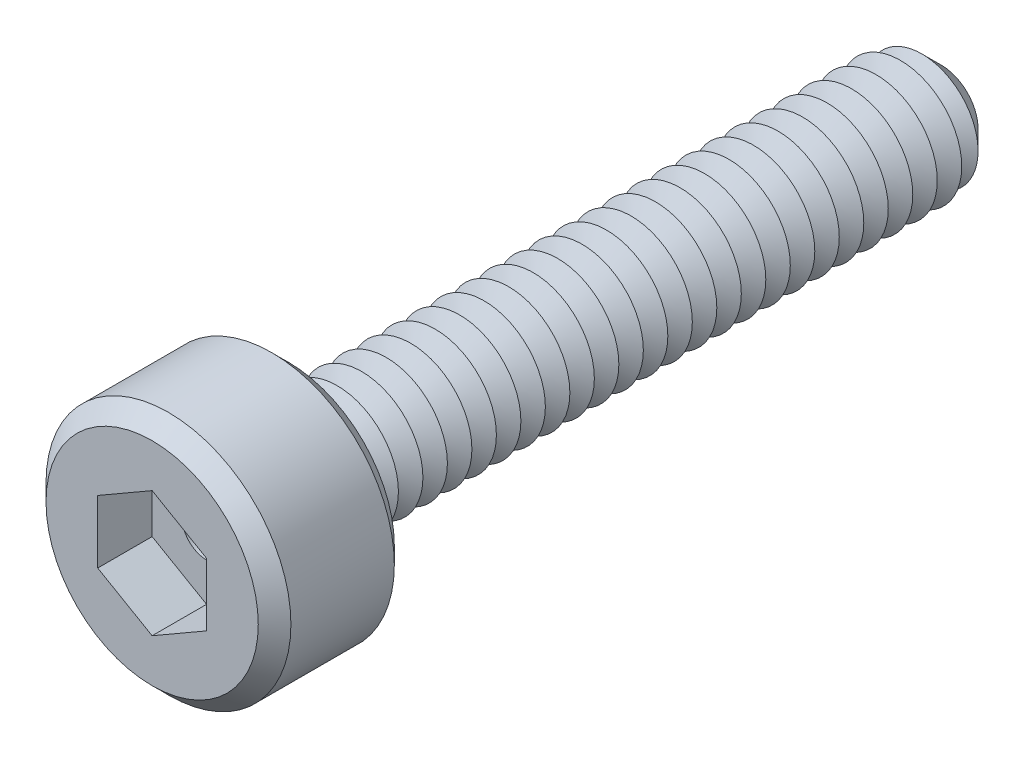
ISO-10303-21;
HEADER;
FILE_DESCRIPTION(('STEP AP214'),'2;1');
FILE_NAME('part.step','',(''),(''),'','','');
FILE_SCHEMA(('AUTOMOTIVE_DESIGN { 1 0 10303 214 1 1 1 1 }'));
ENDSEC;
DATA;
#1=APPLICATION_CONTEXT('core data for automotive mechanical design processes');
#2=APPLICATION_PROTOCOL_DEFINITION('international standard','automotive_design',2000,#1);
#3=PRODUCT_CONTEXT('',#1,'mechanical');
#4=PRODUCT('Part','Part','',(#3));
#5=PRODUCT_RELATED_PRODUCT_CATEGORY('part','',(#4));
#6=PRODUCT_DEFINITION_FORMATION('','',#4);
#7=PRODUCT_DEFINITION_CONTEXT('part definition',#1,'design');
#8=PRODUCT_DEFINITION('design','',#6,#7);
#9=PRODUCT_DEFINITION_SHAPE('','',#8);
#10=(LENGTH_UNIT() NAMED_UNIT(*) SI_UNIT(.MILLI.,.METRE.));
#11=(NAMED_UNIT(*) PLANE_ANGLE_UNIT() SI_UNIT($,.RADIAN.));
#12=(NAMED_UNIT(*) SI_UNIT($,.STERADIAN.) SOLID_ANGLE_UNIT());
#13=UNCERTAINTY_MEASURE_WITH_UNIT(LENGTH_MEASURE(1.E-05),#10,'distance_accuracy_value','');
#14=(GEOMETRIC_REPRESENTATION_CONTEXT(3) GLOBAL_UNCERTAINTY_ASSIGNED_CONTEXT((#13)) GLOBAL_UNIT_ASSIGNED_CONTEXT((#10,
#11,#12)) REPRESENTATION_CONTEXT('',''));
#15=CARTESIAN_POINT('',(0.,0.,0.));
#16=DIRECTION('',(0.,0.,1.));
#17=DIRECTION('',(1.,0.,0.));
#18=AXIS2_PLACEMENT_3D('',#15,#16,#17);
#19=CARTESIAN_POINT('',(0.,0.,2.5));
#20=DIRECTION('',(0.,0.,-1.));
#21=DIRECTION('',(-1.,0.,0.));
#22=AXIS2_PLACEMENT_3D('',#19,#20,#21);
#23=CYLINDRICAL_SURFACE('',#22,2.25);
#24=CARTESIAN_POINT('',(0.,0.,0.299999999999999));
#25=DIRECTION('',(0.,0.,1.));
#26=DIRECTION('',(1.,0.,0.));
#27=AXIS2_PLACEMENT_3D('',#24,#25,#26);
#28=CIRCLE('',#27,2.25);
#29=CARTESIAN_POINT('',(2.25,0.,0.299999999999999));
#30=VERTEX_POINT('',#29);
#31=EDGE_CURVE('E384',#30,#30,#28,.T.);
#32=ORIENTED_EDGE('',*,*,#31,.T.);
#33=EDGE_LOOP('',(#32));
#34=FACE_BOUND('',#33,.T.);
#35=CARTESIAN_POINT('',(0.,0.,2.2));
#36=DIRECTION('',(0.,0.,1.));
#37=DIRECTION('',(1.,0.,0.));
#38=AXIS2_PLACEMENT_3D('',#35,#36,#37);
#39=CIRCLE('',#38,2.25);
#40=CARTESIAN_POINT('',(2.25,0.,2.2));
#41=VERTEX_POINT('',#40);
#42=EDGE_CURVE('E377',#41,#41,#39,.F.);
#43=ORIENTED_EDGE('',*,*,#42,.T.);
#44=EDGE_LOOP('',(#43));
#45=FACE_BOUND('',#44,.T.);
#46=ADVANCED_FACE('F39',(#34,#45),#23,.T.);
#47=CARTESIAN_POINT('',(0.,0.,2.5));
#48=DIRECTION('',(0.,0.,1.));
#49=DIRECTION('',(1.,0.,0.));
#50=AXIS2_PLACEMENT_3D('',#47,#48,#49);
#51=PLANE('',#50);
#52=CARTESIAN_POINT('',(0.,0.,2.5));
#53=DIRECTION('',(0.,0.,1.));
#54=DIRECTION('',(1.,0.,0.));
#55=AXIS2_PLACEMENT_3D('',#52,#53,#54);
#56=CIRCLE('',#55,1.95);
#57=CARTESIAN_POINT('',(1.95,0.,2.5));
#58=VERTEX_POINT('',#57);
#59=EDGE_CURVE('E11',#58,#58,#56,.T.);
#60=ORIENTED_EDGE('',*,*,#59,.T.);
#61=EDGE_LOOP('',(#60));
#62=FACE_BOUND('',#61,.T.);
#63=DIRECTION('',(-0.866025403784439,0.5,0.));
#64=VECTOR('',#63,1.);
#65=CARTESIAN_POINT('',(0.999999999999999,0.577350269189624,2.5));
#66=LINE('',#65,#64);
#67=CARTESIAN_POINT('',(0.999999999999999,0.577350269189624,2.5));
#68=VERTEX_POINT('',#67);
#69=CARTESIAN_POINT('',(0.,1.15470053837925,2.5));
#70=VERTEX_POINT('',#69);
#71=EDGE_CURVE('E55',#68,#70,#66,.T.);
#72=ORIENTED_EDGE('',*,*,#71,.F.);
#73=DIRECTION('',(0.,1.,0.));
#74=VECTOR('',#73,1.);
#75=CARTESIAN_POINT('',(1.,-0.577350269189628,2.5));
#76=LINE('',#75,#74);
#77=CARTESIAN_POINT('',(1.,-0.577350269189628,2.5));
#78=VERTEX_POINT('',#77);
#79=EDGE_CURVE('E150',#78,#68,#76,.T.);
#80=ORIENTED_EDGE('',*,*,#79,.F.);
#81=DIRECTION('',(0.866025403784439,0.5,0.));
#82=VECTOR('',#81,1.);
#83=CARTESIAN_POINT('',(0.,-1.15470053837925,2.5));
#84=LINE('',#83,#82);
#85=CARTESIAN_POINT('',(0.,-1.15470053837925,2.5));
#86=VERTEX_POINT('',#85);
#87=EDGE_CURVE('E147',#86,#78,#84,.T.);
#88=ORIENTED_EDGE('',*,*,#87,.F.);
#89=DIRECTION('',(0.866025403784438,-0.5,0.));
#90=VECTOR('',#89,1.);
#91=CARTESIAN_POINT('',(-1.,-0.577350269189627,2.5));
#92=LINE('',#91,#90);
#93=CARTESIAN_POINT('',(-1.,-0.577350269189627,2.5));
#94=VERTEX_POINT('',#93);
#95=EDGE_CURVE('E103',#94,#86,#92,.T.);
#96=ORIENTED_EDGE('',*,*,#95,.F.);
#97=DIRECTION('',(0.,-1.,0.));
#98=VECTOR('',#97,1.);
#99=CARTESIAN_POINT('',(-1.,0.577350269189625,2.5));
#100=LINE('',#99,#98);
#101=CARTESIAN_POINT('',(-1.,0.577350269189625,2.5));
#102=VERTEX_POINT('',#101);
#103=EDGE_CURVE('E141',#102,#94,#100,.T.);
#104=ORIENTED_EDGE('',*,*,#103,.F.);
#105=DIRECTION('',(-0.866025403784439,-0.5,0.));
#106=VECTOR('',#105,1.);
#107=CARTESIAN_POINT('',(0.,1.15470053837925,2.5));
#108=LINE('',#107,#106);
#109=EDGE_CURVE('E136',#70,#102,#108,.T.);
#110=ORIENTED_EDGE('',*,*,#109,.F.);
#111=EDGE_LOOP('',(#72,#80,#88,#96,#104,#110));
#112=FACE_BOUND('',#111,.T.);
#113=ADVANCED_FACE('F402',(#62,#112),#51,.T.);
#114=CARTESIAN_POINT('',(0.,0.,0.));
#115=DIRECTION('',(0.,0.,1.));
#116=DIRECTION('',(1.,0.,0.));
#117=AXIS2_PLACEMENT_3D('',#114,#115,#116);
#118=PLANE('',#117);
#119=CARTESIAN_POINT('',(0.,0.,0.));
#120=DIRECTION('',(0.,0.,1.));
#121=DIRECTION('',(1.,0.,0.));
#122=AXIS2_PLACEMENT_3D('',#119,#120,#121);
#123=CIRCLE('',#122,1.95);
#124=CARTESIAN_POINT('',(1.95,0.,0.));
#125=VERTEX_POINT('',#124);
#126=EDGE_CURVE('E48',#125,#125,#123,.F.);
#127=ORIENTED_EDGE('',*,*,#126,.T.);
#128=EDGE_LOOP('',(#127));
#129=FACE_BOUND('',#128,.T.);
#130=CARTESIAN_POINT('',(0.,0.,0.));
#131=DIRECTION('',(0.,0.,1.));
#132=DIRECTION('',(1.,0.,0.));
#133=AXIS2_PLACEMENT_3D('',#130,#131,#132);
#134=CIRCLE('',#133,1.125);
#135=CARTESIAN_POINT('',(1.125,0.,0.));
#136=VERTEX_POINT('',#135);
#137=EDGE_CURVE('E369',#136,#136,#134,.T.);
#138=ORIENTED_EDGE('',*,*,#137,.T.);
#139=EDGE_LOOP('',(#138));
#140=FACE_BOUND('',#139,.T.);
#141=ADVANCED_FACE('F391',(#129,#140),#118,.F.);
#142=CARTESIAN_POINT('',(0.,0.,0.));
#143=DIRECTION('',(0.,0.,1.));
#144=DIRECTION('',(1.,0.,0.));
#145=AXIS2_PLACEMENT_3D('',#142,#143,#144);
#146=CONICAL_SURFACE('',#145,1.125,1.0471975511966);
#147=CARTESIAN_POINT('',(0.,0.,-0.225));
#148=DIRECTION('',(0.,0.,1.));
#149=DIRECTION('',(1.,0.,0.));
#150=AXIS2_PLACEMENT_3D('',#147,#148,#149);
#151=CIRCLE('',#150,0.735288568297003);
#152=CARTESIAN_POINT('',(0.735288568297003,0.,-0.225));
#153=VERTEX_POINT('',#152);
#154=EDGE_CURVE('E365',#153,#153,#151,.T.);
#155=ORIENTED_EDGE('',*,*,#154,.T.);
#156=EDGE_LOOP('',(#155));
#157=FACE_BOUND('',#156,.T.);
#158=ORIENTED_EDGE('',*,*,#137,.F.);
#159=EDGE_LOOP('',(#158));
#160=FACE_BOUND('',#159,.T.);
#161=ADVANCED_FACE('F660',(#157,#160),#146,.T.);
#162=CARTESIAN_POINT('',(0.,0.,-0.225));
#163=DIRECTION('',(0.,0.,-1.));
#164=DIRECTION('',(-1.,0.,0.));
#165=AXIS2_PLACEMENT_3D('',#162,#163,#164);
#166=CONICAL_SURFACE('',#165,0.735288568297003,1.0471975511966);
#167=CARTESIAN_POINT('',(0.,0.,-0.45));
#168=DIRECTION('',(0.,0.,1.));
#169=DIRECTION('',(1.,0.,0.));
#170=AXIS2_PLACEMENT_3D('',#167,#168,#169);
#171=CIRCLE('',#170,1.125);
#172=CARTESIAN_POINT('',(1.125,0.,-0.45));
#173=VERTEX_POINT('',#172);
#174=EDGE_CURVE('E361',#173,#173,#171,.T.);
#175=ORIENTED_EDGE('',*,*,#174,.T.);
#176=EDGE_LOOP('',(#175));
#177=FACE_BOUND('',#176,.T.);
#178=ORIENTED_EDGE('',*,*,#154,.F.);
#179=EDGE_LOOP('',(#178));
#180=FACE_BOUND('',#179,.T.);
#181=ADVANCED_FACE('F656',(#177,#180),#166,.T.);
#182=CARTESIAN_POINT('',(0.,0.,-0.45));
#183=DIRECTION('',(0.,0.,1.));
#184=DIRECTION('',(1.,0.,0.));
#185=AXIS2_PLACEMENT_3D('',#182,#183,#184);
#186=CONICAL_SURFACE('',#185,1.125,1.0471975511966);
#187=CARTESIAN_POINT('',(0.,0.,-0.675));
#188=DIRECTION('',(0.,0.,1.));
#189=DIRECTION('',(1.,0.,0.));
#190=AXIS2_PLACEMENT_3D('',#187,#188,#189);
#191=CIRCLE('',#190,0.735288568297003);
#192=CARTESIAN_POINT('',(0.735288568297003,0.,-0.675));
#193=VERTEX_POINT('',#192);
#194=EDGE_CURVE('E357',#193,#193,#191,.T.);
#195=ORIENTED_EDGE('',*,*,#194,.T.);
#196=EDGE_LOOP('',(#195));
#197=FACE_BOUND('',#196,.T.);
#198=ORIENTED_EDGE('',*,*,#174,.F.);
#199=EDGE_LOOP('',(#198));
#200=FACE_BOUND('',#199,.T.);
#201=ADVANCED_FACE('F652',(#197,#200),#186,.T.);
#202=CARTESIAN_POINT('',(0.,0.,-0.675));
#203=DIRECTION('',(0.,0.,-1.));
#204=DIRECTION('',(-1.,0.,0.));
#205=AXIS2_PLACEMENT_3D('',#202,#203,#204);
#206=CONICAL_SURFACE('',#205,0.735288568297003,1.0471975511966);
#207=CARTESIAN_POINT('',(0.,0.,-0.9));
#208=DIRECTION('',(0.,0.,1.));
#209=DIRECTION('',(1.,0.,0.));
#210=AXIS2_PLACEMENT_3D('',#207,#208,#209);
#211=CIRCLE('',#210,1.125);
#212=CARTESIAN_POINT('',(1.125,0.,-0.9));
#213=VERTEX_POINT('',#212);
#214=EDGE_CURVE('E353',#213,#213,#211,.T.);
#215=ORIENTED_EDGE('',*,*,#214,.T.);
#216=EDGE_LOOP('',(#215));
#217=FACE_BOUND('',#216,.T.);
#218=ORIENTED_EDGE('',*,*,#194,.F.);
#219=EDGE_LOOP('',(#218));
#220=FACE_BOUND('',#219,.T.);
#221=ADVANCED_FACE('F648',(#217,#220),#206,.T.);
#222=CARTESIAN_POINT('',(0.,0.,-0.9));
#223=DIRECTION('',(0.,0.,1.));
#224=DIRECTION('',(1.,0.,0.));
#225=AXIS2_PLACEMENT_3D('',#222,#223,#224);
#226=CONICAL_SURFACE('',#225,1.125,1.0471975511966);
#227=CARTESIAN_POINT('',(0.,0.,-1.125));
#228=DIRECTION('',(0.,0.,1.));
#229=DIRECTION('',(1.,0.,0.));
#230=AXIS2_PLACEMENT_3D('',#227,#228,#229);
#231=CIRCLE('',#230,0.735288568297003);
#232=CARTESIAN_POINT('',(0.735288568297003,0.,-1.125));
#233=VERTEX_POINT('',#232);
#234=EDGE_CURVE('E349',#233,#233,#231,.T.);
#235=ORIENTED_EDGE('',*,*,#234,.T.);
#236=EDGE_LOOP('',(#235));
#237=FACE_BOUND('',#236,.T.);
#238=ORIENTED_EDGE('',*,*,#214,.F.);
#239=EDGE_LOOP('',(#238));
#240=FACE_BOUND('',#239,.T.);
#241=ADVANCED_FACE('F644',(#237,#240),#226,.T.);
#242=CARTESIAN_POINT('',(0.,0.,-1.125));
#243=DIRECTION('',(0.,0.,-1.));
#244=DIRECTION('',(-1.,0.,0.));
#245=AXIS2_PLACEMENT_3D('',#242,#243,#244);
#246=CONICAL_SURFACE('',#245,0.735288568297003,1.0471975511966);
#247=CARTESIAN_POINT('',(0.,0.,-1.35));
#248=DIRECTION('',(0.,0.,1.));
#249=DIRECTION('',(1.,0.,0.));
#250=AXIS2_PLACEMENT_3D('',#247,#248,#249);
#251=CIRCLE('',#250,1.125);
#252=CARTESIAN_POINT('',(1.125,0.,-1.35));
#253=VERTEX_POINT('',#252);
#254=EDGE_CURVE('E345',#253,#253,#251,.T.);
#255=ORIENTED_EDGE('',*,*,#254,.T.);
#256=EDGE_LOOP('',(#255));
#257=FACE_BOUND('',#256,.T.);
#258=ORIENTED_EDGE('',*,*,#234,.F.);
#259=EDGE_LOOP('',(#258));
#260=FACE_BOUND('',#259,.T.);
#261=ADVANCED_FACE('F640',(#257,#260),#246,.T.);
#262=CARTESIAN_POINT('',(0.,0.,-1.35));
#263=DIRECTION('',(0.,0.,1.));
#264=DIRECTION('',(1.,0.,0.));
#265=AXIS2_PLACEMENT_3D('',#262,#263,#264);
#266=CONICAL_SURFACE('',#265,1.125,1.0471975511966);
#267=CARTESIAN_POINT('',(0.,0.,-1.575));
#268=DIRECTION('',(0.,0.,1.));
#269=DIRECTION('',(1.,0.,0.));
#270=AXIS2_PLACEMENT_3D('',#267,#268,#269);
#271=CIRCLE('',#270,0.735288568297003);
#272=CARTESIAN_POINT('',(0.735288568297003,0.,-1.575));
#273=VERTEX_POINT('',#272);
#274=EDGE_CURVE('E341',#273,#273,#271,.T.);
#275=ORIENTED_EDGE('',*,*,#274,.T.);
#276=EDGE_LOOP('',(#275));
#277=FACE_BOUND('',#276,.T.);
#278=ORIENTED_EDGE('',*,*,#254,.F.);
#279=EDGE_LOOP('',(#278));
#280=FACE_BOUND('',#279,.T.);
#281=ADVANCED_FACE('F636',(#277,#280),#266,.T.);
#282=CARTESIAN_POINT('',(0.,0.,-1.575));
#283=DIRECTION('',(0.,0.,-1.));
#284=DIRECTION('',(-1.,0.,0.));
#285=AXIS2_PLACEMENT_3D('',#282,#283,#284);
#286=CONICAL_SURFACE('',#285,0.735288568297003,1.0471975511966);
#287=CARTESIAN_POINT('',(0.,0.,-1.8));
#288=DIRECTION('',(0.,0.,1.));
#289=DIRECTION('',(1.,0.,0.));
#290=AXIS2_PLACEMENT_3D('',#287,#288,#289);
#291=CIRCLE('',#290,1.125);
#292=CARTESIAN_POINT('',(1.125,0.,-1.8));
#293=VERTEX_POINT('',#292);
#294=EDGE_CURVE('E337',#293,#293,#291,.T.);
#295=ORIENTED_EDGE('',*,*,#294,.T.);
#296=EDGE_LOOP('',(#295));
#297=FACE_BOUND('',#296,.T.);
#298=ORIENTED_EDGE('',*,*,#274,.F.);
#299=EDGE_LOOP('',(#298));
#300=FACE_BOUND('',#299,.T.);
#301=ADVANCED_FACE('F632',(#297,#300),#286,.T.);
#302=CARTESIAN_POINT('',(0.,0.,-1.8));
#303=DIRECTION('',(0.,0.,1.));
#304=DIRECTION('',(1.,0.,0.));
#305=AXIS2_PLACEMENT_3D('',#302,#303,#304);
#306=CONICAL_SURFACE('',#305,1.125,1.0471975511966);
#307=CARTESIAN_POINT('',(0.,0.,-2.025));
#308=DIRECTION('',(0.,0.,1.));
#309=DIRECTION('',(1.,0.,0.));
#310=AXIS2_PLACEMENT_3D('',#307,#308,#309);
#311=CIRCLE('',#310,0.735288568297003);
#312=CARTESIAN_POINT('',(0.735288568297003,0.,-2.025));
#313=VERTEX_POINT('',#312);
#314=EDGE_CURVE('E333',#313,#313,#311,.T.);
#315=ORIENTED_EDGE('',*,*,#314,.T.);
#316=EDGE_LOOP('',(#315));
#317=FACE_BOUND('',#316,.T.);
#318=ORIENTED_EDGE('',*,*,#294,.F.);
#319=EDGE_LOOP('',(#318));
#320=FACE_BOUND('',#319,.T.);
#321=ADVANCED_FACE('F628',(#317,#320),#306,.T.);
#322=CARTESIAN_POINT('',(0.,0.,-2.025));
#323=DIRECTION('',(0.,0.,-1.));
#324=DIRECTION('',(-1.,0.,0.));
#325=AXIS2_PLACEMENT_3D('',#322,#323,#324);
#326=CONICAL_SURFACE('',#325,0.735288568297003,1.0471975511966);
#327=CARTESIAN_POINT('',(0.,0.,-2.25));
#328=DIRECTION('',(0.,0.,1.));
#329=DIRECTION('',(1.,0.,0.));
#330=AXIS2_PLACEMENT_3D('',#327,#328,#329);
#331=CIRCLE('',#330,1.125);
#332=CARTESIAN_POINT('',(1.125,0.,-2.25));
#333=VERTEX_POINT('',#332);
#334=EDGE_CURVE('E329',#333,#333,#331,.T.);
#335=ORIENTED_EDGE('',*,*,#334,.T.);
#336=EDGE_LOOP('',(#335));
#337=FACE_BOUND('',#336,.T.);
#338=ORIENTED_EDGE('',*,*,#314,.F.);
#339=EDGE_LOOP('',(#338));
#340=FACE_BOUND('',#339,.T.);
#341=ADVANCED_FACE('F624',(#337,#340),#326,.T.);
#342=CARTESIAN_POINT('',(0.,0.,-2.25));
#343=DIRECTION('',(0.,0.,1.));
#344=DIRECTION('',(1.,0.,0.));
#345=AXIS2_PLACEMENT_3D('',#342,#343,#344);
#346=CONICAL_SURFACE('',#345,1.125,1.0471975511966);
#347=CARTESIAN_POINT('',(0.,0.,-2.475));
#348=DIRECTION('',(0.,0.,1.));
#349=DIRECTION('',(1.,0.,0.));
#350=AXIS2_PLACEMENT_3D('',#347,#348,#349);
#351=CIRCLE('',#350,0.735288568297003);
#352=CARTESIAN_POINT('',(0.735288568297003,0.,-2.475));
#353=VERTEX_POINT('',#352);
#354=EDGE_CURVE('E325',#353,#353,#351,.T.);
#355=ORIENTED_EDGE('',*,*,#354,.T.);
#356=EDGE_LOOP('',(#355));
#357=FACE_BOUND('',#356,.T.);
#358=ORIENTED_EDGE('',*,*,#334,.F.);
#359=EDGE_LOOP('',(#358));
#360=FACE_BOUND('',#359,.T.);
#361=ADVANCED_FACE('F620',(#357,#360),#346,.T.);
#362=CARTESIAN_POINT('',(0.,0.,-2.475));
#363=DIRECTION('',(0.,0.,-1.));
#364=DIRECTION('',(-1.,0.,0.));
#365=AXIS2_PLACEMENT_3D('',#362,#363,#364);
#366=CONICAL_SURFACE('',#365,0.735288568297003,1.0471975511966);
#367=CARTESIAN_POINT('',(0.,0.,-2.7));
#368=DIRECTION('',(0.,0.,1.));
#369=DIRECTION('',(1.,0.,0.));
#370=AXIS2_PLACEMENT_3D('',#367,#368,#369);
#371=CIRCLE('',#370,1.125);
#372=CARTESIAN_POINT('',(1.125,0.,-2.7));
#373=VERTEX_POINT('',#372);
#374=EDGE_CURVE('E321',#373,#373,#371,.T.);
#375=ORIENTED_EDGE('',*,*,#374,.T.);
#376=EDGE_LOOP('',(#375));
#377=FACE_BOUND('',#376,.T.);
#378=ORIENTED_EDGE('',*,*,#354,.F.);
#379=EDGE_LOOP('',(#378));
#380=FACE_BOUND('',#379,.T.);
#381=ADVANCED_FACE('F616',(#377,#380),#366,.T.);
#382=CARTESIAN_POINT('',(0.,0.,-2.7));
#383=DIRECTION('',(0.,0.,1.));
#384=DIRECTION('',(1.,0.,0.));
#385=AXIS2_PLACEMENT_3D('',#382,#383,#384);
#386=CONICAL_SURFACE('',#385,1.125,1.0471975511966);
#387=CARTESIAN_POINT('',(0.,0.,-2.925));
#388=DIRECTION('',(0.,0.,1.));
#389=DIRECTION('',(1.,0.,0.));
#390=AXIS2_PLACEMENT_3D('',#387,#388,#389);
#391=CIRCLE('',#390,0.735288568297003);
#392=CARTESIAN_POINT('',(0.735288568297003,0.,-2.925));
#393=VERTEX_POINT('',#392);
#394=EDGE_CURVE('E317',#393,#393,#391,.T.);
#395=ORIENTED_EDGE('',*,*,#394,.T.);
#396=EDGE_LOOP('',(#395));
#397=FACE_BOUND('',#396,.T.);
#398=ORIENTED_EDGE('',*,*,#374,.F.);
#399=EDGE_LOOP('',(#398));
#400=FACE_BOUND('',#399,.T.);
#401=ADVANCED_FACE('F612',(#397,#400),#386,.T.);
#402=CARTESIAN_POINT('',(0.,0.,-2.925));
#403=DIRECTION('',(0.,0.,-1.));
#404=DIRECTION('',(-1.,0.,0.));
#405=AXIS2_PLACEMENT_3D('',#402,#403,#404);
#406=CONICAL_SURFACE('',#405,0.735288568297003,1.0471975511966);
#407=CARTESIAN_POINT('',(0.,0.,-3.15));
#408=DIRECTION('',(0.,0.,1.));
#409=DIRECTION('',(1.,0.,0.));
#410=AXIS2_PLACEMENT_3D('',#407,#408,#409);
#411=CIRCLE('',#410,1.125);
#412=CARTESIAN_POINT('',(1.125,0.,-3.15));
#413=VERTEX_POINT('',#412);
#414=EDGE_CURVE('E313',#413,#413,#411,.T.);
#415=ORIENTED_EDGE('',*,*,#414,.T.);
#416=EDGE_LOOP('',(#415));
#417=FACE_BOUND('',#416,.T.);
#418=ORIENTED_EDGE('',*,*,#394,.F.);
#419=EDGE_LOOP('',(#418));
#420=FACE_BOUND('',#419,.T.);
#421=ADVANCED_FACE('F608',(#417,#420),#406,.T.);
#422=CARTESIAN_POINT('',(0.,0.,-3.15));
#423=DIRECTION('',(0.,0.,1.));
#424=DIRECTION('',(1.,0.,0.));
#425=AXIS2_PLACEMENT_3D('',#422,#423,#424);
#426=CONICAL_SURFACE('',#425,1.125,1.0471975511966);
#427=CARTESIAN_POINT('',(0.,0.,-3.375));
#428=DIRECTION('',(0.,0.,1.));
#429=DIRECTION('',(1.,0.,0.));
#430=AXIS2_PLACEMENT_3D('',#427,#428,#429);
#431=CIRCLE('',#430,0.735288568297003);
#432=CARTESIAN_POINT('',(0.735288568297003,0.,-3.375));
#433=VERTEX_POINT('',#432);
#434=EDGE_CURVE('E309',#433,#433,#431,.T.);
#435=ORIENTED_EDGE('',*,*,#434,.T.);
#436=EDGE_LOOP('',(#435));
#437=FACE_BOUND('',#436,.T.);
#438=ORIENTED_EDGE('',*,*,#414,.F.);
#439=EDGE_LOOP('',(#438));
#440=FACE_BOUND('',#439,.T.);
#441=ADVANCED_FACE('F604',(#437,#440),#426,.T.);
#442=CARTESIAN_POINT('',(0.,0.,-3.375));
#443=DIRECTION('',(0.,0.,-1.));
#444=DIRECTION('',(-1.,0.,0.));
#445=AXIS2_PLACEMENT_3D('',#442,#443,#444);
#446=CONICAL_SURFACE('',#445,0.735288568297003,1.0471975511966);
#447=CARTESIAN_POINT('',(0.,0.,-3.6));
#448=DIRECTION('',(0.,0.,1.));
#449=DIRECTION('',(1.,0.,0.));
#450=AXIS2_PLACEMENT_3D('',#447,#448,#449);
#451=CIRCLE('',#450,1.125);
#452=CARTESIAN_POINT('',(1.125,0.,-3.6));
#453=VERTEX_POINT('',#452);
#454=EDGE_CURVE('E305',#453,#453,#451,.T.);
#455=ORIENTED_EDGE('',*,*,#454,.T.);
#456=EDGE_LOOP('',(#455));
#457=FACE_BOUND('',#456,.T.);
#458=ORIENTED_EDGE('',*,*,#434,.F.);
#459=EDGE_LOOP('',(#458));
#460=FACE_BOUND('',#459,.T.);
#461=ADVANCED_FACE('F600',(#457,#460),#446,.T.);
#462=CARTESIAN_POINT('',(0.,0.,-3.6));
#463=DIRECTION('',(0.,0.,1.));
#464=DIRECTION('',(1.,0.,0.));
#465=AXIS2_PLACEMENT_3D('',#462,#463,#464);
#466=CONICAL_SURFACE('',#465,1.125,1.0471975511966);
#467=CARTESIAN_POINT('',(0.,0.,-3.825));
#468=DIRECTION('',(0.,0.,1.));
#469=DIRECTION('',(1.,0.,0.));
#470=AXIS2_PLACEMENT_3D('',#467,#468,#469);
#471=CIRCLE('',#470,0.735288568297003);
#472=CARTESIAN_POINT('',(0.735288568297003,0.,-3.825));
#473=VERTEX_POINT('',#472);
#474=EDGE_CURVE('E301',#473,#473,#471,.T.);
#475=ORIENTED_EDGE('',*,*,#474,.T.);
#476=EDGE_LOOP('',(#475));
#477=FACE_BOUND('',#476,.T.);
#478=ORIENTED_EDGE('',*,*,#454,.F.);
#479=EDGE_LOOP('',(#478));
#480=FACE_BOUND('',#479,.T.);
#481=ADVANCED_FACE('F596',(#477,#480),#466,.T.);
#482=CARTESIAN_POINT('',(0.,0.,-3.825));
#483=DIRECTION('',(0.,0.,-1.));
#484=DIRECTION('',(-1.,0.,0.));
#485=AXIS2_PLACEMENT_3D('',#482,#483,#484);
#486=CONICAL_SURFACE('',#485,0.735288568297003,1.0471975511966);
#487=CARTESIAN_POINT('',(0.,0.,-4.05));
#488=DIRECTION('',(0.,0.,1.));
#489=DIRECTION('',(1.,0.,0.));
#490=AXIS2_PLACEMENT_3D('',#487,#488,#489);
#491=CIRCLE('',#490,1.125);
#492=CARTESIAN_POINT('',(1.125,0.,-4.05));
#493=VERTEX_POINT('',#492);
#494=EDGE_CURVE('E297',#493,#493,#491,.T.);
#495=ORIENTED_EDGE('',*,*,#494,.T.);
#496=EDGE_LOOP('',(#495));
#497=FACE_BOUND('',#496,.T.);
#498=ORIENTED_EDGE('',*,*,#474,.F.);
#499=EDGE_LOOP('',(#498));
#500=FACE_BOUND('',#499,.T.);
#501=ADVANCED_FACE('F592',(#497,#500),#486,.T.);
#502=CARTESIAN_POINT('',(0.,0.,-4.05));
#503=DIRECTION('',(0.,0.,1.));
#504=DIRECTION('',(1.,0.,0.));
#505=AXIS2_PLACEMENT_3D('',#502,#503,#504);
#506=CONICAL_SURFACE('',#505,1.125,1.0471975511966);
#507=CARTESIAN_POINT('',(0.,0.,-4.275));
#508=DIRECTION('',(0.,0.,1.));
#509=DIRECTION('',(1.,0.,0.));
#510=AXIS2_PLACEMENT_3D('',#507,#508,#509);
#511=CIRCLE('',#510,0.735288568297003);
#512=CARTESIAN_POINT('',(0.735288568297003,0.,-4.275));
#513=VERTEX_POINT('',#512);
#514=EDGE_CURVE('E293',#513,#513,#511,.T.);
#515=ORIENTED_EDGE('',*,*,#514,.T.);
#516=EDGE_LOOP('',(#515));
#517=FACE_BOUND('',#516,.T.);
#518=ORIENTED_EDGE('',*,*,#494,.F.);
#519=EDGE_LOOP('',(#518));
#520=FACE_BOUND('',#519,.T.);
#521=ADVANCED_FACE('F588',(#517,#520),#506,.T.);
#522=CARTESIAN_POINT('',(0.,0.,-4.275));
#523=DIRECTION('',(0.,0.,-1.));
#524=DIRECTION('',(-1.,0.,0.));
#525=AXIS2_PLACEMENT_3D('',#522,#523,#524);
#526=CONICAL_SURFACE('',#525,0.735288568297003,1.0471975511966);
#527=CARTESIAN_POINT('',(0.,0.,-4.5));
#528=DIRECTION('',(0.,0.,1.));
#529=DIRECTION('',(1.,0.,0.));
#530=AXIS2_PLACEMENT_3D('',#527,#528,#529);
#531=CIRCLE('',#530,1.125);
#532=CARTESIAN_POINT('',(1.125,0.,-4.5));
#533=VERTEX_POINT('',#532);
#534=EDGE_CURVE('E289',#533,#533,#531,.T.);
#535=ORIENTED_EDGE('',*,*,#534,.T.);
#536=EDGE_LOOP('',(#535));
#537=FACE_BOUND('',#536,.T.);
#538=ORIENTED_EDGE('',*,*,#514,.F.);
#539=EDGE_LOOP('',(#538));
#540=FACE_BOUND('',#539,.T.);
#541=ADVANCED_FACE('F584',(#537,#540),#526,.T.);
#542=CARTESIAN_POINT('',(0.,0.,-4.5));
#543=DIRECTION('',(0.,0.,1.));
#544=DIRECTION('',(1.,0.,0.));
#545=AXIS2_PLACEMENT_3D('',#542,#543,#544);
#546=CONICAL_SURFACE('',#545,1.125,1.0471975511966);
#547=CARTESIAN_POINT('',(0.,0.,-4.725));
#548=DIRECTION('',(0.,0.,1.));
#549=DIRECTION('',(1.,0.,0.));
#550=AXIS2_PLACEMENT_3D('',#547,#548,#549);
#551=CIRCLE('',#550,0.735288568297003);
#552=CARTESIAN_POINT('',(0.735288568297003,0.,-4.725));
#553=VERTEX_POINT('',#552);
#554=EDGE_CURVE('E285',#553,#553,#551,.T.);
#555=ORIENTED_EDGE('',*,*,#554,.T.);
#556=EDGE_LOOP('',(#555));
#557=FACE_BOUND('',#556,.T.);
#558=ORIENTED_EDGE('',*,*,#534,.F.);
#559=EDGE_LOOP('',(#558));
#560=FACE_BOUND('',#559,.T.);
#561=ADVANCED_FACE('F580',(#557,#560),#546,.T.);
#562=CARTESIAN_POINT('',(0.,0.,-4.725));
#563=DIRECTION('',(0.,0.,-1.));
#564=DIRECTION('',(-1.,0.,0.));
#565=AXIS2_PLACEMENT_3D('',#562,#563,#564);
#566=CONICAL_SURFACE('',#565,0.735288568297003,1.0471975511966);
#567=CARTESIAN_POINT('',(0.,0.,-4.95));
#568=DIRECTION('',(0.,0.,1.));
#569=DIRECTION('',(1.,0.,0.));
#570=AXIS2_PLACEMENT_3D('',#567,#568,#569);
#571=CIRCLE('',#570,1.125);
#572=CARTESIAN_POINT('',(1.125,0.,-4.95));
#573=VERTEX_POINT('',#572);
#574=EDGE_CURVE('E281',#573,#573,#571,.T.);
#575=ORIENTED_EDGE('',*,*,#574,.T.);
#576=EDGE_LOOP('',(#575));
#577=FACE_BOUND('',#576,.T.);
#578=ORIENTED_EDGE('',*,*,#554,.F.);
#579=EDGE_LOOP('',(#578));
#580=FACE_BOUND('',#579,.T.);
#581=ADVANCED_FACE('F576',(#577,#580),#566,.T.);
#582=CARTESIAN_POINT('',(0.,0.,-4.95));
#583=DIRECTION('',(0.,0.,1.));
#584=DIRECTION('',(1.,0.,0.));
#585=AXIS2_PLACEMENT_3D('',#582,#583,#584);
#586=CONICAL_SURFACE('',#585,1.125,1.0471975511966);
#587=CARTESIAN_POINT('',(0.,0.,-5.175));
#588=DIRECTION('',(0.,0.,1.));
#589=DIRECTION('',(1.,0.,0.));
#590=AXIS2_PLACEMENT_3D('',#587,#588,#589);
#591=CIRCLE('',#590,0.735288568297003);
#592=CARTESIAN_POINT('',(0.735288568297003,0.,-5.175));
#593=VERTEX_POINT('',#592);
#594=EDGE_CURVE('E277',#593,#593,#591,.T.);
#595=ORIENTED_EDGE('',*,*,#594,.T.);
#596=EDGE_LOOP('',(#595));
#597=FACE_BOUND('',#596,.T.);
#598=ORIENTED_EDGE('',*,*,#574,.F.);
#599=EDGE_LOOP('',(#598));
#600=FACE_BOUND('',#599,.T.);
#601=ADVANCED_FACE('F572',(#597,#600),#586,.T.);
#602=CARTESIAN_POINT('',(0.,0.,-5.175));
#603=DIRECTION('',(0.,0.,-1.));
#604=DIRECTION('',(-1.,0.,0.));
#605=AXIS2_PLACEMENT_3D('',#602,#603,#604);
#606=CONICAL_SURFACE('',#605,0.735288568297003,1.0471975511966);
#607=CARTESIAN_POINT('',(0.,0.,-5.4));
#608=DIRECTION('',(0.,0.,1.));
#609=DIRECTION('',(1.,0.,0.));
#610=AXIS2_PLACEMENT_3D('',#607,#608,#609);
#611=CIRCLE('',#610,1.125);
#612=CARTESIAN_POINT('',(1.125,0.,-5.4));
#613=VERTEX_POINT('',#612);
#614=EDGE_CURVE('E273',#613,#613,#611,.T.);
#615=ORIENTED_EDGE('',*,*,#614,.T.);
#616=EDGE_LOOP('',(#615));
#617=FACE_BOUND('',#616,.T.);
#618=ORIENTED_EDGE('',*,*,#594,.F.);
#619=EDGE_LOOP('',(#618));
#620=FACE_BOUND('',#619,.T.);
#621=ADVANCED_FACE('F568',(#617,#620),#606,.T.);
#622=CARTESIAN_POINT('',(0.,0.,-5.4));
#623=DIRECTION('',(0.,0.,1.));
#624=DIRECTION('',(1.,0.,0.));
#625=AXIS2_PLACEMENT_3D('',#622,#623,#624);
#626=CONICAL_SURFACE('',#625,1.125,1.0471975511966);
#627=CARTESIAN_POINT('',(0.,0.,-5.625));
#628=DIRECTION('',(0.,0.,1.));
#629=DIRECTION('',(1.,0.,0.));
#630=AXIS2_PLACEMENT_3D('',#627,#628,#629);
#631=CIRCLE('',#630,0.735288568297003);
#632=CARTESIAN_POINT('',(0.735288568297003,0.,-5.625));
#633=VERTEX_POINT('',#632);
#634=EDGE_CURVE('E269',#633,#633,#631,.T.);
#635=ORIENTED_EDGE('',*,*,#634,.T.);
#636=EDGE_LOOP('',(#635));
#637=FACE_BOUND('',#636,.T.);
#638=ORIENTED_EDGE('',*,*,#614,.F.);
#639=EDGE_LOOP('',(#638));
#640=FACE_BOUND('',#639,.T.);
#641=ADVANCED_FACE('F564',(#637,#640),#626,.T.);
#642=CARTESIAN_POINT('',(0.,0.,-5.625));
#643=DIRECTION('',(0.,0.,-1.));
#644=DIRECTION('',(-1.,0.,0.));
#645=AXIS2_PLACEMENT_3D('',#642,#643,#644);
#646=CONICAL_SURFACE('',#645,0.735288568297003,1.0471975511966);
#647=CARTESIAN_POINT('',(0.,0.,-5.85));
#648=DIRECTION('',(0.,0.,1.));
#649=DIRECTION('',(1.,0.,0.));
#650=AXIS2_PLACEMENT_3D('',#647,#648,#649);
#651=CIRCLE('',#650,1.125);
#652=CARTESIAN_POINT('',(1.125,0.,-5.85));
#653=VERTEX_POINT('',#652);
#654=EDGE_CURVE('E265',#653,#653,#651,.T.);
#655=ORIENTED_EDGE('',*,*,#654,.T.);
#656=EDGE_LOOP('',(#655));
#657=FACE_BOUND('',#656,.T.);
#658=ORIENTED_EDGE('',*,*,#634,.F.);
#659=EDGE_LOOP('',(#658));
#660=FACE_BOUND('',#659,.T.);
#661=ADVANCED_FACE('F560',(#657,#660),#646,.T.);
#662=CARTESIAN_POINT('',(0.,0.,-5.85));
#663=DIRECTION('',(0.,0.,1.));
#664=DIRECTION('',(1.,0.,0.));
#665=AXIS2_PLACEMENT_3D('',#662,#663,#664);
#666=CONICAL_SURFACE('',#665,1.125,1.0471975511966);
#667=CARTESIAN_POINT('',(0.,0.,-6.075));
#668=DIRECTION('',(0.,0.,1.));
#669=DIRECTION('',(1.,0.,0.));
#670=AXIS2_PLACEMENT_3D('',#667,#668,#669);
#671=CIRCLE('',#670,0.735288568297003);
#672=CARTESIAN_POINT('',(0.735288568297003,0.,-6.075));
#673=VERTEX_POINT('',#672);
#674=EDGE_CURVE('E261',#673,#673,#671,.T.);
#675=ORIENTED_EDGE('',*,*,#674,.T.);
#676=EDGE_LOOP('',(#675));
#677=FACE_BOUND('',#676,.T.);
#678=ORIENTED_EDGE('',*,*,#654,.F.);
#679=EDGE_LOOP('',(#678));
#680=FACE_BOUND('',#679,.T.);
#681=ADVANCED_FACE('F556',(#677,#680),#666,.T.);
#682=CARTESIAN_POINT('',(0.,0.,-6.075));
#683=DIRECTION('',(0.,0.,-1.));
#684=DIRECTION('',(-1.,0.,0.));
#685=AXIS2_PLACEMENT_3D('',#682,#683,#684);
#686=CONICAL_SURFACE('',#685,0.735288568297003,1.0471975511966);
#687=CARTESIAN_POINT('',(0.,0.,-6.3));
#688=DIRECTION('',(0.,0.,1.));
#689=DIRECTION('',(1.,0.,0.));
#690=AXIS2_PLACEMENT_3D('',#687,#688,#689);
#691=CIRCLE('',#690,1.125);
#692=CARTESIAN_POINT('',(1.125,0.,-6.3));
#693=VERTEX_POINT('',#692);
#694=EDGE_CURVE('E257',#693,#693,#691,.T.);
#695=ORIENTED_EDGE('',*,*,#694,.T.);
#696=EDGE_LOOP('',(#695));
#697=FACE_BOUND('',#696,.T.);
#698=ORIENTED_EDGE('',*,*,#674,.F.);
#699=EDGE_LOOP('',(#698));
#700=FACE_BOUND('',#699,.T.);
#701=ADVANCED_FACE('F552',(#697,#700),#686,.T.);
#702=CARTESIAN_POINT('',(0.,0.,-6.3));
#703=DIRECTION('',(0.,0.,1.));
#704=DIRECTION('',(1.,0.,0.));
#705=AXIS2_PLACEMENT_3D('',#702,#703,#704);
#706=CONICAL_SURFACE('',#705,1.125,1.0471975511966);
#707=CARTESIAN_POINT('',(0.,0.,-6.525));
#708=DIRECTION('',(0.,0.,1.));
#709=DIRECTION('',(1.,0.,0.));
#710=AXIS2_PLACEMENT_3D('',#707,#708,#709);
#711=CIRCLE('',#710,0.735288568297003);
#712=CARTESIAN_POINT('',(0.735288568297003,0.,-6.525));
#713=VERTEX_POINT('',#712);
#714=EDGE_CURVE('E253',#713,#713,#711,.T.);
#715=ORIENTED_EDGE('',*,*,#714,.T.);
#716=EDGE_LOOP('',(#715));
#717=FACE_BOUND('',#716,.T.);
#718=ORIENTED_EDGE('',*,*,#694,.F.);
#719=EDGE_LOOP('',(#718));
#720=FACE_BOUND('',#719,.T.);
#721=ADVANCED_FACE('F548',(#717,#720),#706,.T.);
#722=CARTESIAN_POINT('',(0.,0.,-6.525));
#723=DIRECTION('',(0.,0.,-1.));
#724=DIRECTION('',(-1.,0.,0.));
#725=AXIS2_PLACEMENT_3D('',#722,#723,#724);
#726=CONICAL_SURFACE('',#725,0.735288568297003,1.0471975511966);
#727=CARTESIAN_POINT('',(0.,0.,-6.75));
#728=DIRECTION('',(0.,0.,1.));
#729=DIRECTION('',(1.,0.,0.));
#730=AXIS2_PLACEMENT_3D('',#727,#728,#729);
#731=CIRCLE('',#730,1.125);
#732=CARTESIAN_POINT('',(1.125,0.,-6.75));
#733=VERTEX_POINT('',#732);
#734=EDGE_CURVE('E249',#733,#733,#731,.T.);
#735=ORIENTED_EDGE('',*,*,#734,.T.);
#736=EDGE_LOOP('',(#735));
#737=FACE_BOUND('',#736,.T.);
#738=ORIENTED_EDGE('',*,*,#714,.F.);
#739=EDGE_LOOP('',(#738));
#740=FACE_BOUND('',#739,.T.);
#741=ADVANCED_FACE('F544',(#737,#740),#726,.T.);
#742=CARTESIAN_POINT('',(0.,0.,-6.75));
#743=DIRECTION('',(0.,0.,1.));
#744=DIRECTION('',(1.,0.,0.));
#745=AXIS2_PLACEMENT_3D('',#742,#743,#744);
#746=CONICAL_SURFACE('',#745,1.125,1.0471975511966);
#747=CARTESIAN_POINT('',(0.,0.,-6.975));
#748=DIRECTION('',(0.,0.,1.));
#749=DIRECTION('',(1.,0.,0.));
#750=AXIS2_PLACEMENT_3D('',#747,#748,#749);
#751=CIRCLE('',#750,0.735288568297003);
#752=CARTESIAN_POINT('',(0.735288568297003,0.,-6.975));
#753=VERTEX_POINT('',#752);
#754=EDGE_CURVE('E245',#753,#753,#751,.T.);
#755=ORIENTED_EDGE('',*,*,#754,.T.);
#756=EDGE_LOOP('',(#755));
#757=FACE_BOUND('',#756,.T.);
#758=ORIENTED_EDGE('',*,*,#734,.F.);
#759=EDGE_LOOP('',(#758));
#760=FACE_BOUND('',#759,.T.);
#761=ADVANCED_FACE('F540',(#757,#760),#746,.T.);
#762=CARTESIAN_POINT('',(0.,0.,-6.975));
#763=DIRECTION('',(0.,0.,-1.));
#764=DIRECTION('',(-1.,0.,0.));
#765=AXIS2_PLACEMENT_3D('',#762,#763,#764);
#766=CONICAL_SURFACE('',#765,0.735288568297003,1.0471975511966);
#767=CARTESIAN_POINT('',(0.,0.,-7.2));
#768=DIRECTION('',(0.,0.,1.));
#769=DIRECTION('',(1.,0.,0.));
#770=AXIS2_PLACEMENT_3D('',#767,#768,#769);
#771=CIRCLE('',#770,1.125);
#772=CARTESIAN_POINT('',(1.125,0.,-7.2));
#773=VERTEX_POINT('',#772);
#774=EDGE_CURVE('E241',#773,#773,#771,.T.);
#775=ORIENTED_EDGE('',*,*,#774,.T.);
#776=EDGE_LOOP('',(#775));
#777=FACE_BOUND('',#776,.T.);
#778=ORIENTED_EDGE('',*,*,#754,.F.);
#779=EDGE_LOOP('',(#778));
#780=FACE_BOUND('',#779,.T.);
#781=ADVANCED_FACE('F536',(#777,#780),#766,.T.);
#782=CARTESIAN_POINT('',(0.,0.,-7.2));
#783=DIRECTION('',(0.,0.,1.));
#784=DIRECTION('',(1.,0.,0.));
#785=AXIS2_PLACEMENT_3D('',#782,#783,#784);
#786=CONICAL_SURFACE('',#785,1.125,1.0471975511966);
#787=CARTESIAN_POINT('',(0.,0.,-7.425));
#788=DIRECTION('',(0.,0.,1.));
#789=DIRECTION('',(1.,0.,0.));
#790=AXIS2_PLACEMENT_3D('',#787,#788,#789);
#791=CIRCLE('',#790,0.735288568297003);
#792=CARTESIAN_POINT('',(0.735288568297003,0.,-7.425));
#793=VERTEX_POINT('',#792);
#794=EDGE_CURVE('E237',#793,#793,#791,.T.);
#795=ORIENTED_EDGE('',*,*,#794,.T.);
#796=EDGE_LOOP('',(#795));
#797=FACE_BOUND('',#796,.T.);
#798=ORIENTED_EDGE('',*,*,#774,.F.);
#799=EDGE_LOOP('',(#798));
#800=FACE_BOUND('',#799,.T.);
#801=ADVANCED_FACE('F532',(#797,#800),#786,.T.);
#802=CARTESIAN_POINT('',(0.,0.,-7.425));
#803=DIRECTION('',(0.,0.,-1.));
#804=DIRECTION('',(-1.,0.,0.));
#805=AXIS2_PLACEMENT_3D('',#802,#803,#804);
#806=CONICAL_SURFACE('',#805,0.735288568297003,1.0471975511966);
#807=CARTESIAN_POINT('',(0.,0.,-7.65));
#808=DIRECTION('',(0.,0.,1.));
#809=DIRECTION('',(1.,0.,0.));
#810=AXIS2_PLACEMENT_3D('',#807,#808,#809);
#811=CIRCLE('',#810,1.125);
#812=CARTESIAN_POINT('',(1.125,0.,-7.65));
#813=VERTEX_POINT('',#812);
#814=EDGE_CURVE('E233',#813,#813,#811,.T.);
#815=ORIENTED_EDGE('',*,*,#814,.T.);
#816=EDGE_LOOP('',(#815));
#817=FACE_BOUND('',#816,.T.);
#818=ORIENTED_EDGE('',*,*,#794,.F.);
#819=EDGE_LOOP('',(#818));
#820=FACE_BOUND('',#819,.T.);
#821=ADVANCED_FACE('F528',(#817,#820),#806,.T.);
#822=CARTESIAN_POINT('',(0.,0.,-7.65));
#823=DIRECTION('',(0.,0.,1.));
#824=DIRECTION('',(1.,0.,0.));
#825=AXIS2_PLACEMENT_3D('',#822,#823,#824);
#826=CONICAL_SURFACE('',#825,1.125,1.0471975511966);
#827=CARTESIAN_POINT('',(0.,0.,-7.875));
#828=DIRECTION('',(0.,0.,1.));
#829=DIRECTION('',(1.,0.,0.));
#830=AXIS2_PLACEMENT_3D('',#827,#828,#829);
#831=CIRCLE('',#830,0.735288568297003);
#832=CARTESIAN_POINT('',(0.735288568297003,0.,-7.875));
#833=VERTEX_POINT('',#832);
#834=EDGE_CURVE('E229',#833,#833,#831,.T.);
#835=ORIENTED_EDGE('',*,*,#834,.T.);
#836=EDGE_LOOP('',(#835));
#837=FACE_BOUND('',#836,.T.);
#838=ORIENTED_EDGE('',*,*,#814,.F.);
#839=EDGE_LOOP('',(#838));
#840=FACE_BOUND('',#839,.T.);
#841=ADVANCED_FACE('F524',(#837,#840),#826,.T.);
#842=CARTESIAN_POINT('',(0.,0.,-7.875));
#843=DIRECTION('',(0.,0.,-1.));
#844=DIRECTION('',(-1.,0.,0.));
#845=AXIS2_PLACEMENT_3D('',#842,#843,#844);
#846=CONICAL_SURFACE('',#845,0.735288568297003,1.0471975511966);
#847=CARTESIAN_POINT('',(0.,0.,-8.1));
#848=DIRECTION('',(0.,0.,1.));
#849=DIRECTION('',(1.,0.,0.));
#850=AXIS2_PLACEMENT_3D('',#847,#848,#849);
#851=CIRCLE('',#850,1.125);
#852=CARTESIAN_POINT('',(1.125,0.,-8.1));
#853=VERTEX_POINT('',#852);
#854=EDGE_CURVE('E225',#853,#853,#851,.T.);
#855=ORIENTED_EDGE('',*,*,#854,.T.);
#856=EDGE_LOOP('',(#855));
#857=FACE_BOUND('',#856,.T.);
#858=ORIENTED_EDGE('',*,*,#834,.F.);
#859=EDGE_LOOP('',(#858));
#860=FACE_BOUND('',#859,.T.);
#861=ADVANCED_FACE('F520',(#857,#860),#846,.T.);
#862=CARTESIAN_POINT('',(0.,0.,-8.1));
#863=DIRECTION('',(0.,0.,1.));
#864=DIRECTION('',(1.,0.,0.));
#865=AXIS2_PLACEMENT_3D('',#862,#863,#864);
#866=CONICAL_SURFACE('',#865,1.125,1.0471975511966);
#867=CARTESIAN_POINT('',(0.,0.,-8.325));
#868=DIRECTION('',(0.,0.,1.));
#869=DIRECTION('',(1.,0.,0.));
#870=AXIS2_PLACEMENT_3D('',#867,#868,#869);
#871=CIRCLE('',#870,0.735288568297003);
#872=CARTESIAN_POINT('',(0.735288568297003,0.,-8.325));
#873=VERTEX_POINT('',#872);
#874=EDGE_CURVE('E221',#873,#873,#871,.T.);
#875=ORIENTED_EDGE('',*,*,#874,.T.);
#876=EDGE_LOOP('',(#875));
#877=FACE_BOUND('',#876,.T.);
#878=ORIENTED_EDGE('',*,*,#854,.F.);
#879=EDGE_LOOP('',(#878));
#880=FACE_BOUND('',#879,.T.);
#881=ADVANCED_FACE('F516',(#877,#880),#866,.T.);
#882=CARTESIAN_POINT('',(0.,0.,-8.325));
#883=DIRECTION('',(0.,0.,-1.));
#884=DIRECTION('',(-1.,0.,0.));
#885=AXIS2_PLACEMENT_3D('',#882,#883,#884);
#886=CONICAL_SURFACE('',#885,0.735288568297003,1.0471975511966);
#887=CARTESIAN_POINT('',(0.,0.,-8.55));
#888=DIRECTION('',(0.,0.,1.));
#889=DIRECTION('',(1.,0.,0.));
#890=AXIS2_PLACEMENT_3D('',#887,#888,#889);
#891=CIRCLE('',#890,1.125);
#892=CARTESIAN_POINT('',(1.125,0.,-8.55));
#893=VERTEX_POINT('',#892);
#894=EDGE_CURVE('E217',#893,#893,#891,.T.);
#895=ORIENTED_EDGE('',*,*,#894,.T.);
#896=EDGE_LOOP('',(#895));
#897=FACE_BOUND('',#896,.T.);
#898=ORIENTED_EDGE('',*,*,#874,.F.);
#899=EDGE_LOOP('',(#898));
#900=FACE_BOUND('',#899,.T.);
#901=ADVANCED_FACE('F512',(#897,#900),#886,.T.);
#902=CARTESIAN_POINT('',(0.,0.,-8.55));
#903=DIRECTION('',(0.,0.,1.));
#904=DIRECTION('',(1.,0.,0.));
#905=AXIS2_PLACEMENT_3D('',#902,#903,#904);
#906=CONICAL_SURFACE('',#905,1.125,1.0471975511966);
#907=CARTESIAN_POINT('',(0.,0.,-8.775));
#908=DIRECTION('',(0.,0.,1.));
#909=DIRECTION('',(1.,0.,0.));
#910=AXIS2_PLACEMENT_3D('',#907,#908,#909);
#911=CIRCLE('',#910,0.735288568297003);
#912=CARTESIAN_POINT('',(0.735288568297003,0.,-8.775));
#913=VERTEX_POINT('',#912);
#914=EDGE_CURVE('E213',#913,#913,#911,.T.);
#915=ORIENTED_EDGE('',*,*,#914,.T.);
#916=EDGE_LOOP('',(#915));
#917=FACE_BOUND('',#916,.T.);
#918=ORIENTED_EDGE('',*,*,#894,.F.);
#919=EDGE_LOOP('',(#918));
#920=FACE_BOUND('',#919,.T.);
#921=ADVANCED_FACE('F508',(#917,#920),#906,.T.);
#922=CARTESIAN_POINT('',(0.,0.,-8.775));
#923=DIRECTION('',(0.,0.,-1.));
#924=DIRECTION('',(-1.,0.,0.));
#925=AXIS2_PLACEMENT_3D('',#922,#923,#924);
#926=CONICAL_SURFACE('',#925,0.735288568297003,1.0471975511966);
#927=CARTESIAN_POINT('',(0.,0.,-9.));
#928=DIRECTION('',(0.,0.,1.));
#929=DIRECTION('',(1.,0.,0.));
#930=AXIS2_PLACEMENT_3D('',#927,#928,#929);
#931=CIRCLE('',#930,1.125);
#932=CARTESIAN_POINT('',(1.125,0.,-9.));
#933=VERTEX_POINT('',#932);
#934=EDGE_CURVE('E209',#933,#933,#931,.T.);
#935=ORIENTED_EDGE('',*,*,#934,.T.);
#936=EDGE_LOOP('',(#935));
#937=FACE_BOUND('',#936,.T.);
#938=ORIENTED_EDGE('',*,*,#914,.F.);
#939=EDGE_LOOP('',(#938));
#940=FACE_BOUND('',#939,.T.);
#941=ADVANCED_FACE('F504',(#937,#940),#926,.T.);
#942=CARTESIAN_POINT('',(0.,0.,-9.));
#943=DIRECTION('',(0.,0.,1.));
#944=DIRECTION('',(1.,0.,0.));
#945=AXIS2_PLACEMENT_3D('',#942,#943,#944);
#946=CONICAL_SURFACE('',#945,1.125,1.0471975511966);
#947=CARTESIAN_POINT('',(0.,0.,-9.225));
#948=DIRECTION('',(0.,0.,1.));
#949=DIRECTION('',(1.,0.,0.));
#950=AXIS2_PLACEMENT_3D('',#947,#948,#949);
#951=CIRCLE('',#950,0.735288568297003);
#952=CARTESIAN_POINT('',(0.735288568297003,0.,-9.225));
#953=VERTEX_POINT('',#952);
#954=EDGE_CURVE('E205',#953,#953,#951,.T.);
#955=ORIENTED_EDGE('',*,*,#954,.T.);
#956=EDGE_LOOP('',(#955));
#957=FACE_BOUND('',#956,.T.);
#958=ORIENTED_EDGE('',*,*,#934,.F.);
#959=EDGE_LOOP('',(#958));
#960=FACE_BOUND('',#959,.T.);
#961=ADVANCED_FACE('F500',(#957,#960),#946,.T.);
#962=CARTESIAN_POINT('',(0.,0.,-9.225));
#963=DIRECTION('',(0.,0.,-1.));
#964=DIRECTION('',(-1.,0.,0.));
#965=AXIS2_PLACEMENT_3D('',#962,#963,#964);
#966=CONICAL_SURFACE('',#965,0.735288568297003,1.0471975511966);
#967=CARTESIAN_POINT('',(0.,0.,-9.45));
#968=DIRECTION('',(0.,0.,1.));
#969=DIRECTION('',(1.,0.,0.));
#970=AXIS2_PLACEMENT_3D('',#967,#968,#969);
#971=CIRCLE('',#970,1.125);
#972=CARTESIAN_POINT('',(1.125,0.,-9.45));
#973=VERTEX_POINT('',#972);
#974=EDGE_CURVE('E201',#973,#973,#971,.T.);
#975=ORIENTED_EDGE('',*,*,#974,.T.);
#976=EDGE_LOOP('',(#975));
#977=FACE_BOUND('',#976,.T.);
#978=ORIENTED_EDGE('',*,*,#954,.F.);
#979=EDGE_LOOP('',(#978));
#980=FACE_BOUND('',#979,.T.);
#981=ADVANCED_FACE('F496',(#977,#980),#966,.T.);
#982=CARTESIAN_POINT('',(0.,0.,-9.45));
#983=DIRECTION('',(0.,0.,1.));
#984=DIRECTION('',(1.,0.,0.));
#985=AXIS2_PLACEMENT_3D('',#982,#983,#984);
#986=CONICAL_SURFACE('',#985,1.125,1.0471975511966);
#987=CARTESIAN_POINT('',(0.,0.,-9.675));
#988=DIRECTION('',(0.,0.,1.));
#989=DIRECTION('',(1.,0.,0.));
#990=AXIS2_PLACEMENT_3D('',#987,#988,#989);
#991=CIRCLE('',#990,0.735288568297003);
#992=CARTESIAN_POINT('',(0.735288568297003,0.,-9.675));
#993=VERTEX_POINT('',#992);
#994=EDGE_CURVE('E197',#993,#993,#991,.T.);
#995=ORIENTED_EDGE('',*,*,#994,.T.);
#996=EDGE_LOOP('',(#995));
#997=FACE_BOUND('',#996,.T.);
#998=ORIENTED_EDGE('',*,*,#974,.F.);
#999=EDGE_LOOP('',(#998));
#1000=FACE_BOUND('',#999,.T.);
#1001=ADVANCED_FACE('F492',(#997,#1000),#986,.T.);
#1002=CARTESIAN_POINT('',(0.,0.,-9.675));
#1003=DIRECTION('',(0.,0.,-1.));
#1004=DIRECTION('',(-1.,0.,0.));
#1005=AXIS2_PLACEMENT_3D('',#1002,#1003,#1004);
#1006=CONICAL_SURFACE('',#1005,0.735288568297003,1.0471975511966);
#1007=CARTESIAN_POINT('',(0.,0.,-9.9));
#1008=DIRECTION('',(0.,0.,1.));
#1009=DIRECTION('',(1.,0.,0.));
#1010=AXIS2_PLACEMENT_3D('',#1007,#1008,#1009);
#1011=CIRCLE('',#1010,1.125);
#1012=CARTESIAN_POINT('',(1.125,0.,-9.9));
#1013=VERTEX_POINT('',#1012);
#1014=EDGE_CURVE('E193',#1013,#1013,#1011,.T.);
#1015=ORIENTED_EDGE('',*,*,#1014,.T.);
#1016=EDGE_LOOP('',(#1015));
#1017=FACE_BOUND('',#1016,.T.);
#1018=ORIENTED_EDGE('',*,*,#994,.F.);
#1019=EDGE_LOOP('',(#1018));
#1020=FACE_BOUND('',#1019,.T.);
#1021=ADVANCED_FACE('F488',(#1017,#1020),#1006,.T.);
#1022=CARTESIAN_POINT('',(0.,0.,-9.9));
#1023=DIRECTION('',(0.,0.,1.));
#1024=DIRECTION('',(1.,0.,0.));
#1025=AXIS2_PLACEMENT_3D('',#1022,#1023,#1024);
#1026=CONICAL_SURFACE('',#1025,1.125,1.0471975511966);
#1027=CARTESIAN_POINT('',(0.,0.,-10.125));
#1028=DIRECTION('',(0.,0.,1.));
#1029=DIRECTION('',(1.,0.,0.));
#1030=AXIS2_PLACEMENT_3D('',#1027,#1028,#1029);
#1031=CIRCLE('',#1030,0.735288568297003);
#1032=CARTESIAN_POINT('',(0.735288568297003,0.,-10.125));
#1033=VERTEX_POINT('',#1032);
#1034=EDGE_CURVE('E189',#1033,#1033,#1031,.T.);
#1035=ORIENTED_EDGE('',*,*,#1034,.T.);
#1036=EDGE_LOOP('',(#1035));
#1037=FACE_BOUND('',#1036,.T.);
#1038=ORIENTED_EDGE('',*,*,#1014,.F.);
#1039=EDGE_LOOP('',(#1038));
#1040=FACE_BOUND('',#1039,.T.);
#1041=ADVANCED_FACE('F484',(#1037,#1040),#1026,.T.);
#1042=CARTESIAN_POINT('',(0.,0.,-10.125));
#1043=DIRECTION('',(0.,0.,-1.));
#1044=DIRECTION('',(-1.,0.,0.));
#1045=AXIS2_PLACEMENT_3D('',#1042,#1043,#1044);
#1046=CONICAL_SURFACE('',#1045,0.735288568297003,1.0471975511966);
#1047=CARTESIAN_POINT('',(0.,0.,-10.35));
#1048=DIRECTION('',(0.,0.,1.));
#1049=DIRECTION('',(1.,0.,0.));
#1050=AXIS2_PLACEMENT_3D('',#1047,#1048,#1049);
#1051=CIRCLE('',#1050,1.125);
#1052=CARTESIAN_POINT('',(1.125,0.,-10.35));
#1053=VERTEX_POINT('',#1052);
#1054=EDGE_CURVE('E185',#1053,#1053,#1051,.T.);
#1055=ORIENTED_EDGE('',*,*,#1054,.T.);
#1056=EDGE_LOOP('',(#1055));
#1057=FACE_BOUND('',#1056,.T.);
#1058=ORIENTED_EDGE('',*,*,#1034,.F.);
#1059=EDGE_LOOP('',(#1058));
#1060=FACE_BOUND('',#1059,.T.);
#1061=ADVANCED_FACE('F480',(#1057,#1060),#1046,.T.);
#1062=CARTESIAN_POINT('',(0.,0.,-10.35));
#1063=DIRECTION('',(0.,0.,1.));
#1064=DIRECTION('',(1.,0.,0.));
#1065=AXIS2_PLACEMENT_3D('',#1062,#1063,#1064);
#1066=CONICAL_SURFACE('',#1065,1.125,1.0471975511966);
#1067=CARTESIAN_POINT('',(0.,0.,-10.575));
#1068=DIRECTION('',(0.,0.,1.));
#1069=DIRECTION('',(1.,0.,0.));
#1070=AXIS2_PLACEMENT_3D('',#1067,#1068,#1069);
#1071=CIRCLE('',#1070,0.735288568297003);
#1072=CARTESIAN_POINT('',(0.735288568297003,0.,-10.575));
#1073=VERTEX_POINT('',#1072);
#1074=EDGE_CURVE('E181',#1073,#1073,#1071,.T.);
#1075=ORIENTED_EDGE('',*,*,#1074,.T.);
#1076=EDGE_LOOP('',(#1075));
#1077=FACE_BOUND('',#1076,.T.);
#1078=ORIENTED_EDGE('',*,*,#1054,.F.);
#1079=EDGE_LOOP('',(#1078));
#1080=FACE_BOUND('',#1079,.T.);
#1081=ADVANCED_FACE('F476',(#1077,#1080),#1066,.T.);
#1082=CARTESIAN_POINT('',(0.,0.,-10.575));
#1083=DIRECTION('',(0.,0.,-1.));
#1084=DIRECTION('',(-1.,0.,0.));
#1085=AXIS2_PLACEMENT_3D('',#1082,#1083,#1084);
#1086=CONICAL_SURFACE('',#1085,0.735288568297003,1.0471975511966);
#1087=CARTESIAN_POINT('',(0.,0.,-10.8));
#1088=DIRECTION('',(0.,0.,1.));
#1089=DIRECTION('',(1.,0.,0.));
#1090=AXIS2_PLACEMENT_3D('',#1087,#1088,#1089);
#1091=CIRCLE('',#1090,1.125);
#1092=CARTESIAN_POINT('',(1.125,0.,-10.8));
#1093=VERTEX_POINT('',#1092);
#1094=EDGE_CURVE('E177',#1093,#1093,#1091,.T.);
#1095=ORIENTED_EDGE('',*,*,#1094,.T.);
#1096=EDGE_LOOP('',(#1095));
#1097=FACE_BOUND('',#1096,.T.);
#1098=ORIENTED_EDGE('',*,*,#1074,.F.);
#1099=EDGE_LOOP('',(#1098));
#1100=FACE_BOUND('',#1099,.T.);
#1101=ADVANCED_FACE('F472',(#1097,#1100),#1086,.T.);
#1102=CARTESIAN_POINT('',(0.,0.,-10.8));
#1103=DIRECTION('',(0.,0.,1.));
#1104=DIRECTION('',(1.,0.,0.));
#1105=AXIS2_PLACEMENT_3D('',#1102,#1103,#1104);
#1106=CONICAL_SURFACE('',#1105,1.125,1.0471975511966);
#1107=CARTESIAN_POINT('',(0.,0.,-11.025));
#1108=DIRECTION('',(0.,0.,1.));
#1109=DIRECTION('',(1.,0.,0.));
#1110=AXIS2_PLACEMENT_3D('',#1107,#1108,#1109);
#1111=CIRCLE('',#1110,0.735288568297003);
#1112=CARTESIAN_POINT('',(0.735288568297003,0.,-11.025));
#1113=VERTEX_POINT('',#1112);
#1114=EDGE_CURVE('E173',#1113,#1113,#1111,.T.);
#1115=ORIENTED_EDGE('',*,*,#1114,.T.);
#1116=EDGE_LOOP('',(#1115));
#1117=FACE_BOUND('',#1116,.T.);
#1118=ORIENTED_EDGE('',*,*,#1094,.F.);
#1119=EDGE_LOOP('',(#1118));
#1120=FACE_BOUND('',#1119,.T.);
#1121=ADVANCED_FACE('F468',(#1117,#1120),#1106,.T.);
#1122=CARTESIAN_POINT('',(0.,0.,-11.025));
#1123=DIRECTION('',(0.,0.,-1.));
#1124=DIRECTION('',(-1.,0.,0.));
#1125=AXIS2_PLACEMENT_3D('',#1122,#1123,#1124);
#1126=CONICAL_SURFACE('',#1125,0.735288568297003,1.0471975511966);
#1127=CARTESIAN_POINT('',(0.,0.,-11.25));
#1128=DIRECTION('',(0.,0.,1.));
#1129=DIRECTION('',(1.,0.,0.));
#1130=AXIS2_PLACEMENT_3D('',#1127,#1128,#1129);
#1131=CIRCLE('',#1130,1.125);
#1132=CARTESIAN_POINT('',(1.125,0.,-11.25));
#1133=VERTEX_POINT('',#1132);
#1134=EDGE_CURVE('E168',#1133,#1133,#1131,.T.);
#1135=ORIENTED_EDGE('',*,*,#1134,.T.);
#1136=EDGE_LOOP('',(#1135));
#1137=FACE_BOUND('',#1136,.T.);
#1138=ORIENTED_EDGE('',*,*,#1114,.F.);
#1139=EDGE_LOOP('',(#1138));
#1140=FACE_BOUND('',#1139,.T.);
#1141=ADVANCED_FACE('F464',(#1137,#1140),#1126,.T.);
#1142=CARTESIAN_POINT('',(0.,0.,-11.25));
#1143=DIRECTION('',(0.,0.,1.));
#1144=DIRECTION('',(1.,0.,0.));
#1145=AXIS2_PLACEMENT_3D('',#1142,#1143,#1144);
#1146=CONICAL_SURFACE('',#1145,1.125,1.0471975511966);
#1147=CARTESIAN_POINT('',(0.,0.,-11.475));
#1148=DIRECTION('',(0.,0.,1.));
#1149=DIRECTION('',(1.,0.,0.));
#1150=AXIS2_PLACEMENT_3D('',#1147,#1148,#1149);
#1151=CIRCLE('',#1150,0.735288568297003);
#1152=CARTESIAN_POINT('',(0.735288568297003,0.,-11.475));
#1153=VERTEX_POINT('',#1152);
#1154=EDGE_CURVE('E155',#1153,#1153,#1151,.T.);
#1155=ORIENTED_EDGE('',*,*,#1154,.T.);
#1156=EDGE_LOOP('',(#1155));
#1157=FACE_BOUND('',#1156,.T.);
#1158=ORIENTED_EDGE('',*,*,#1134,.F.);
#1159=EDGE_LOOP('',(#1158));
#1160=FACE_BOUND('',#1159,.T.);
#1161=ADVANCED_FACE('F460',(#1157,#1160),#1146,.T.);
#1162=CARTESIAN_POINT('',(0.,0.,-11.475));
#1163=DIRECTION('',(0.,0.,-1.));
#1164=DIRECTION('',(-1.,0.,0.));
#1165=AXIS2_PLACEMENT_3D('',#1162,#1163,#1164);
#1166=CONICAL_SURFACE('',#1165,0.735288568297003,1.0471975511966);
#1167=CARTESIAN_POINT('',(0.,0.,-11.6450961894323));
#1168=DIRECTION('',(0.,0.,-1.));
#1169=DIRECTION('',(-1.,0.,0.));
#1170=AXIS2_PLACEMENT_3D('',#1167,#1168,#1169);
#1171=CIRCLE('',#1170,1.02990381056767);
#1172=CARTESIAN_POINT('',(-1.02990381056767,0.,-11.6450961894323));
#1173=VERTEX_POINT('',#1172);
#1174=EDGE_CURVE('E172',#1173,#1173,#1171,.T.);
#1175=ORIENTED_EDGE('',*,*,#1174,.F.);
#1176=EDGE_LOOP('',(#1175));
#1177=FACE_BOUND('',#1176,.T.);
#1178=ORIENTED_EDGE('',*,*,#1154,.F.);
#1179=EDGE_LOOP('',(#1178));
#1180=FACE_BOUND('',#1179,.T.);
#1181=ADVANCED_FACE('F456',(#1177,#1180),#1166,.T.);
#1182=CARTESIAN_POINT('',(0.,0.,-12.));
#1183=DIRECTION('',(0.,0.,-1.));
#1184=DIRECTION('',(-1.,0.,0.));
#1185=AXIS2_PLACEMENT_3D('',#1182,#1183,#1184);
#1186=PLANE('',#1185);
#1187=CARTESIAN_POINT('',(0.,0.,-12.));
#1188=DIRECTION('',(0.,0.,-1.));
#1189=DIRECTION('',(-1.,0.,0.));
#1190=AXIS2_PLACEMENT_3D('',#1187,#1188,#1189);
#1191=CIRCLE('',#1190,0.45);
#1192=CARTESIAN_POINT('',(-0.45,0.,-12.));
#1193=VERTEX_POINT('',#1192);
#1194=EDGE_CURVE('E137',#1193,#1193,#1191,.F.);
#1195=ORIENTED_EDGE('',*,*,#1194,.T.);
#1196=EDGE_LOOP('',(#1195));
#1197=FACE_BOUND('',#1196,.T.);
#1198=CARTESIAN_POINT('',(0.,0.,-12.));
#1199=DIRECTION('',(0.,0.,-1.));
#1200=DIRECTION('',(-1.,0.,0.));
#1201=AXIS2_PLACEMENT_3D('',#1198,#1199,#1200);
#1202=CIRCLE('',#1201,0.675000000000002);
#1203=CARTESIAN_POINT('',(-0.675000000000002,0.,-12.));
#1204=VERTEX_POINT('',#1203);
#1205=EDGE_CURVE('E373',#1204,#1204,#1202,.T.);
#1206=ORIENTED_EDGE('',*,*,#1205,.T.);
#1207=EDGE_LOOP('',(#1206));
#1208=FACE_BOUND('',#1207,.T.);
#1209=ADVANCED_FACE('F459',(#1197,#1208),#1186,.T.);
#1210=CARTESIAN_POINT('',(0.,0.,-12.));
#1211=DIRECTION('',(0.,0.,1.));
#1212=DIRECTION('',(1.,0.,0.));
#1213=AXIS2_PLACEMENT_3D('',#1210,#1211,#1212);
#1214=CONICAL_SURFACE('',#1213,0.675000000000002,0.785398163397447);
#1215=ORIENTED_EDGE('',*,*,#1205,.F.);
#1216=EDGE_LOOP('',(#1215));
#1217=FACE_BOUND('',#1216,.T.);
#1218=ORIENTED_EDGE('',*,*,#1174,.T.);
#1219=EDGE_LOOP('',(#1218));
#1220=FACE_BOUND('',#1219,.T.);
#1221=ADVANCED_FACE('F455',(#1217,#1220),#1214,.T.);
#1222=CARTESIAN_POINT('',(0.999999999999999,0.577350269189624,1.5));
#1223=DIRECTION('',(0.5,0.866025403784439,0.));
#1224=DIRECTION('',(-0.866025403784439,0.5,0.));
#1225=AXIS2_PLACEMENT_3D('',#1222,#1223,#1224);
#1226=PLANE('',#1225);
#1227=ORIENTED_EDGE('',*,*,#71,.T.);
#1228=DIRECTION('',(0.,0.,1.));
#1229=VECTOR('',#1228,1.);
#1230=CARTESIAN_POINT('',(0.,1.15470053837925,1.5));
#1231=LINE('',#1230,#1229);
#1232=CARTESIAN_POINT('',(0.,1.15470053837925,1.5));
#1233=VERTEX_POINT('',#1232);
#1234=EDGE_CURVE('E85',#1233,#70,#1231,.T.);
#1235=ORIENTED_EDGE('',*,*,#1234,.F.);
#1236=DIRECTION('',(-0.866025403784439,0.5,0.));
#1237=VECTOR('',#1236,1.);
#1238=CARTESIAN_POINT('',(0.999999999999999,0.577350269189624,1.5));
#1239=LINE('',#1238,#1237);
#1240=CARTESIAN_POINT('',(0.999999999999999,0.577350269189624,1.5));
#1241=VERTEX_POINT('',#1240);
#1242=EDGE_CURVE('E153',#1241,#1233,#1239,.T.);
#1243=ORIENTED_EDGE('',*,*,#1242,.F.);
#1244=DIRECTION('',(0.,0.,1.));
#1245=VECTOR('',#1244,1.);
#1246=CARTESIAN_POINT('',(0.999999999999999,0.577350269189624,1.5));
#1247=LINE('',#1246,#1245);
#1248=EDGE_CURVE('E63',#1241,#68,#1247,.T.);
#1249=ORIENTED_EDGE('',*,*,#1248,.T.);
#1250=EDGE_LOOP('',(#1227,#1235,#1243,#1249));
#1251=FACE_BOUND('',#1250,.T.);
#1252=ADVANCED_FACE('F445',(#1251),#1226,.F.);
#1253=CARTESIAN_POINT('',(1.,-0.577350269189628,1.5));
#1254=DIRECTION('',(1.,0.,0.));
#1255=DIRECTION('',(0.,1.,0.));
#1256=AXIS2_PLACEMENT_3D('',#1253,#1254,#1255);
#1257=PLANE('',#1256);
#1258=ORIENTED_EDGE('',*,*,#79,.T.);
#1259=ORIENTED_EDGE('',*,*,#1248,.F.);
#1260=DIRECTION('',(0.,1.,0.));
#1261=VECTOR('',#1260,1.);
#1262=CARTESIAN_POINT('',(1.,-0.577350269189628,1.5));
#1263=LINE('',#1262,#1261);
#1264=CARTESIAN_POINT('',(1.,-0.577350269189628,1.5));
#1265=VERTEX_POINT('',#1264);
#1266=EDGE_CURVE('E117',#1265,#1241,#1263,.T.);
#1267=ORIENTED_EDGE('',*,*,#1266,.F.);
#1268=DIRECTION('',(0.,0.,1.));
#1269=VECTOR('',#1268,1.);
#1270=CARTESIAN_POINT('',(1.,-0.577350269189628,1.5));
#1271=LINE('',#1270,#1269);
#1272=EDGE_CURVE('E108',#1265,#78,#1271,.T.);
#1273=ORIENTED_EDGE('',*,*,#1272,.T.);
#1274=EDGE_LOOP('',(#1258,#1259,#1267,#1273));
#1275=FACE_BOUND('',#1274,.T.);
#1276=ADVANCED_FACE('F442',(#1275),#1257,.F.);
#1277=CARTESIAN_POINT('',(0.,-1.15470053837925,1.5));
#1278=DIRECTION('',(0.5,-0.866025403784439,0.));
#1279=DIRECTION('',(0.866025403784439,0.5,0.));
#1280=AXIS2_PLACEMENT_3D('',#1277,#1278,#1279);
#1281=PLANE('',#1280);
#1282=ORIENTED_EDGE('',*,*,#87,.T.);
#1283=ORIENTED_EDGE('',*,*,#1272,.F.);
#1284=DIRECTION('',(0.866025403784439,0.5,0.));
#1285=VECTOR('',#1284,1.);
#1286=CARTESIAN_POINT('',(0.,-1.15470053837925,1.5));
#1287=LINE('',#1286,#1285);
#1288=CARTESIAN_POINT('',(0.,-1.15470053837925,1.5));
#1289=VERTEX_POINT('',#1288);
#1290=EDGE_CURVE('E112',#1289,#1265,#1287,.T.);
#1291=ORIENTED_EDGE('',*,*,#1290,.F.);
#1292=DIRECTION('',(0.,0.,1.));
#1293=VECTOR('',#1292,1.);
#1294=CARTESIAN_POINT('',(0.,-1.15470053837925,1.5));
#1295=LINE('',#1294,#1293);
#1296=EDGE_CURVE('E96',#1289,#86,#1295,.T.);
#1297=ORIENTED_EDGE('',*,*,#1296,.T.);
#1298=EDGE_LOOP('',(#1282,#1283,#1291,#1297));
#1299=FACE_BOUND('',#1298,.T.);
#1300=ADVANCED_FACE('F113',(#1299),#1281,.F.);
#1301=CARTESIAN_POINT('',(-1.,-0.577350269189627,1.5));
#1302=DIRECTION('',(-0.5,-0.866025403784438,0.));
#1303=DIRECTION('',(0.866025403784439,-0.5,0.));
#1304=AXIS2_PLACEMENT_3D('',#1301,#1302,#1303);
#1305=PLANE('',#1304);
#1306=ORIENTED_EDGE('',*,*,#95,.T.);
#1307=ORIENTED_EDGE('',*,*,#1296,.F.);
#1308=DIRECTION('',(0.866025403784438,-0.5,0.));
#1309=VECTOR('',#1308,1.);
#1310=CARTESIAN_POINT('',(-1.,-0.577350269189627,1.5));
#1311=LINE('',#1310,#1309);
#1312=CARTESIAN_POINT('',(-1.,-0.577350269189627,1.5));
#1313=VERTEX_POINT('',#1312);
#1314=EDGE_CURVE('E100',#1313,#1289,#1311,.T.);
#1315=ORIENTED_EDGE('',*,*,#1314,.F.);
#1316=DIRECTION('',(0.,0.,1.));
#1317=VECTOR('',#1316,1.);
#1318=CARTESIAN_POINT('',(-1.,-0.577350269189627,1.5));
#1319=LINE('',#1318,#1317);
#1320=EDGE_CURVE('E109',#1313,#94,#1319,.T.);
#1321=ORIENTED_EDGE('',*,*,#1320,.T.);
#1322=EDGE_LOOP('',(#1306,#1307,#1315,#1321));
#1323=FACE_BOUND('',#1322,.T.);
#1324=ADVANCED_FACE('F98',(#1323),#1305,.F.);
#1325=CARTESIAN_POINT('',(-1.,0.577350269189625,1.5));
#1326=DIRECTION('',(-1.,0.,0.));
#1327=DIRECTION('',(0.,0.,1.));
#1328=AXIS2_PLACEMENT_3D('',#1325,#1326,#1327);
#1329=PLANE('',#1328);
#1330=ORIENTED_EDGE('',*,*,#103,.T.);
#1331=ORIENTED_EDGE('',*,*,#1320,.F.);
#1332=DIRECTION('',(0.,-1.,0.));
#1333=VECTOR('',#1332,1.);
#1334=CARTESIAN_POINT('',(-1.,0.577350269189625,1.5));
#1335=LINE('',#1334,#1333);
#1336=CARTESIAN_POINT('',(-1.,0.577350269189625,1.5));
#1337=VERTEX_POINT('',#1336);
#1338=EDGE_CURVE('E123',#1337,#1313,#1335,.T.);
#1339=ORIENTED_EDGE('',*,*,#1338,.F.);
#1340=DIRECTION('',(0.,0.,1.));
#1341=VECTOR('',#1340,1.);
#1342=CARTESIAN_POINT('',(-1.,0.577350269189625,1.5));
#1343=LINE('',#1342,#1341);
#1344=EDGE_CURVE('E160',#1337,#102,#1343,.T.);
#1345=ORIENTED_EDGE('',*,*,#1344,.T.);
#1346=EDGE_LOOP('',(#1330,#1331,#1339,#1345));
#1347=FACE_BOUND('',#1346,.T.);
#1348=ADVANCED_FACE('F439',(#1347),#1329,.F.);
#1349=CARTESIAN_POINT('',(0.,1.15470053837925,1.5));
#1350=DIRECTION('',(-0.5,0.866025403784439,0.));
#1351=DIRECTION('',(-0.866025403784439,-0.5,0.));
#1352=AXIS2_PLACEMENT_3D('',#1349,#1350,#1351);
#1353=PLANE('',#1352);
#1354=ORIENTED_EDGE('',*,*,#109,.T.);
#1355=ORIENTED_EDGE('',*,*,#1344,.F.);
#1356=DIRECTION('',(-0.866025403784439,-0.5,0.));
#1357=VECTOR('',#1356,1.);
#1358=CARTESIAN_POINT('',(0.,1.15470053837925,1.5));
#1359=LINE('',#1358,#1357);
#1360=EDGE_CURVE('E129',#1233,#1337,#1359,.T.);
#1361=ORIENTED_EDGE('',*,*,#1360,.F.);
#1362=ORIENTED_EDGE('',*,*,#1234,.T.);
#1363=EDGE_LOOP('',(#1354,#1355,#1361,#1362));
#1364=FACE_BOUND('',#1363,.T.);
#1365=ADVANCED_FACE('F417',(#1364),#1353,.F.);
#1366=CARTESIAN_POINT('',(0.,0.,1.5));
#1367=DIRECTION('',(0.,0.,1.));
#1368=DIRECTION('',(1.,0.,0.));
#1369=AXIS2_PLACEMENT_3D('',#1366,#1367,#1368);
#1370=PLANE('',#1369);
#1371=CARTESIAN_POINT('',(0.,0.,1.5));
#1372=DIRECTION('',(0.,0.,1.));
#1373=DIRECTION('',(1.,0.,0.));
#1374=AXIS2_PLACEMENT_3D('',#1371,#1372,#1373);
#1375=CIRCLE('',#1374,0.45);
#1376=CARTESIAN_POINT('',(0.45,0.,1.5));
#1377=VERTEX_POINT('',#1376);
#1378=EDGE_CURVE('E426',#1377,#1377,#1375,.T.);
#1379=ORIENTED_EDGE('',*,*,#1378,.F.);
#1380=EDGE_LOOP('',(#1379));
#1381=FACE_BOUND('',#1380,.T.);
#1382=ORIENTED_EDGE('',*,*,#1242,.T.);
#1383=ORIENTED_EDGE('',*,*,#1360,.T.);
#1384=ORIENTED_EDGE('',*,*,#1338,.T.);
#1385=ORIENTED_EDGE('',*,*,#1314,.T.);
#1386=ORIENTED_EDGE('',*,*,#1290,.T.);
#1387=ORIENTED_EDGE('',*,*,#1266,.T.);
#1388=EDGE_LOOP('',(#1382,#1383,#1384,#1385,#1386,#1387));
#1389=FACE_BOUND('',#1388,.T.);
#1390=ADVANCED_FACE('F120',(#1381,#1389),#1370,.T.);
#1391=CARTESIAN_POINT('',(0.,0.,-13.2727922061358));
#1392=DIRECTION('',(0.,0.,1.));
#1393=DIRECTION('',(1.,0.,0.));
#1394=AXIS2_PLACEMENT_3D('',#1391,#1392,#1393);
#1395=CYLINDRICAL_SURFACE('',#1394,0.45);
#1396=ORIENTED_EDGE('',*,*,#1378,.T.);
#1397=EDGE_LOOP('',(#1396));
#1398=FACE_BOUND('',#1397,.T.);
#1399=ORIENTED_EDGE('',*,*,#1194,.F.);
#1400=EDGE_LOOP('',(#1399));
#1401=FACE_BOUND('',#1400,.T.);
#1402=ADVANCED_FACE('F397',(#1398,#1401),#1395,.F.);
#1403=CARTESIAN_POINT('',(0.,0.,0.299999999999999));
#1404=DIRECTION('',(0.,0.,1.));
#1405=DIRECTION('',(1.,0.,0.));
#1406=AXIS2_PLACEMENT_3D('',#1403,#1404,#1405);
#1407=CONICAL_SURFACE('',#1406,2.25,0.785398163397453);
#1408=ORIENTED_EDGE('',*,*,#126,.F.);
#1409=EDGE_LOOP('',(#1408));
#1410=FACE_BOUND('',#1409,.T.);
#1411=ORIENTED_EDGE('',*,*,#31,.F.);
#1412=EDGE_LOOP('',(#1411));
#1413=FACE_BOUND('',#1412,.T.);
#1414=ADVANCED_FACE('F394',(#1410,#1413),#1407,.T.);
#1415=CARTESIAN_POINT('',(0.,0.,2.5));
#1416=DIRECTION('',(0.,0.,-1.));
#1417=DIRECTION('',(-1.,0.,0.));
#1418=AXIS2_PLACEMENT_3D('',#1415,#1416,#1417);
#1419=CONICAL_SURFACE('',#1418,1.95,0.785398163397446);
#1420=ORIENTED_EDGE('',*,*,#42,.F.);
#1421=EDGE_LOOP('',(#1420));
#1422=FACE_BOUND('',#1421,.T.);
#1423=ORIENTED_EDGE('',*,*,#59,.F.);
#1424=EDGE_LOOP('',(#1423));
#1425=FACE_BOUND('',#1424,.T.);
#1426=ADVANCED_FACE('F41',(#1422,#1425),#1419,.T.);
#1427=CLOSED_SHELL('',(#46,#113,#141,#161,#181,#201,#221,#241,#261,#281,#301,#321,#341,#361,
#381,#401,#421,#441,#461,#481,#501,#521,#541,#561,#581,#601,#621,#641,#661,#681,#701,#721,#741,
#761,#781,#801,#821,#841,#861,#881,#901,#921,#941,#961,#981,#1001,#1021,#1041,#1061,#1081,#1101,
#1121,#1141,#1161,#1181,#1209,#1221,#1252,#1276,#1300,#1324,#1348,#1365,#1390,#1402,#1414,#1426));
#1428=MANIFOLD_SOLID_BREP('B2',#1427);
#1429=ADVANCED_BREP_SHAPE_REPRESENTATION('',(#18,#1428),#14);
#1430=SHAPE_DEFINITION_REPRESENTATION(#9,#1429);
ENDSEC;
END-ISO-10303-21;
